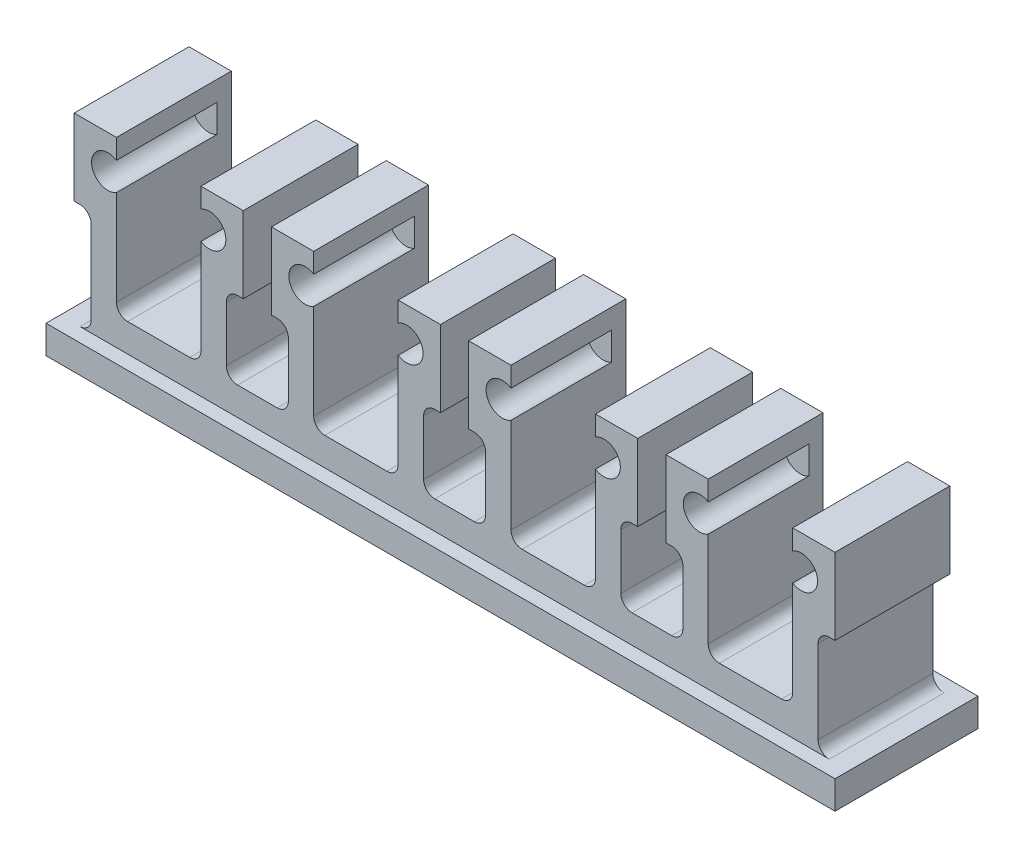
from build123d import *

# Parameters (mm, degrees)
SKETCH1_W          = 12
SKETCH1_H          = 6.3
EXTRUDE1_DEPTH     = 12.92
SKETCH3_W          = 6
SKETCH3_H          = 6.3
CUT_EXTRUDE1_DEPTH = 10.92
SKETCH4_R          = 1.16
CUT_EXTRUDE2_DEPTH = 6.3
SKETCH5_W          = 1.2
SKETCH5_H          = 6.3
CUT_EXTRUDE3_DEPTH = 7.5
FILLET9_R          = 0.79375
FILLET10_R         = 0.79375
FILLET11_R         = 0.79375
FILLET12_R         = 0.79375
SKETCH9_W          = 6.3
SKETCH9_H          = 2
EXTRUDE2_DEPTH     = 4.8
LPATTERN1_COUNT    = 4
LPATTERN1_PITCH    = 14
SKETCH10_W         = 6.3
SKETCH10_H         = 2
CUT_EXTRUDE4_DEPTH = 4.8
FILLET13_R         = 0.79375
FILLET14_R         = 0.79375
FILLET15_R         = 0.79375
FILLET16_R         = 0.79375
FILLET17_R         = 0.79375
FILLET18_R         = 0.79375
SKETCH11_W         = 56
SKETCH11_H         = 8.3
EXTRUDE3_DEPTH     = 2
FILLET21_R         = 0.79375
FILLET22_R         = 0.79375
EXTRUDE4_START     = 0.85
EXTRUDE4_DEPTH     = 0.85
EXTRUDE5_START     = 1
EXTRUDE5_DEPTH     = 1
EXTRUDE6_DEPTH     = 1.85


with BuildPart() as part:
    # Sketch1 → Extrude1 (new body)
    with BuildSketch(Plane(origin=(0, 0, 0), x_dir=(1, 0, 0), z_dir=(0, 1, 0))):
        with Locations((6, 3.15)):
            Rectangle(SKETCH1_W, SKETCH1_H)
    extrude(amount=EXTRUDE1_DEPTH)

    # Sketch3 → Cut-Extrude1 (cut)
    with BuildSketch(Plane(origin=(0, 12.92, 0), x_dir=(-1, 0, 0), z_dir=(0, 1, 0))):
        with Locations((-6, -3.15)):
            Rectangle(SKETCH3_W, SKETCH3_H)
    extrude(amount=-CUT_EXTRUDE1_DEPTH, mode=Mode.SUBTRACT)

    # Sketch4 → Cut-Extrude2 (cut)
    with BuildSketch(Plane.XY):
        with Locations((2.395, 10.52)):
            Circle(SKETCH4_R)
        with Locations((9.605, 10.52)):
            Circle(SKETCH4_R)
    extrude(amount=-CUT_EXTRUDE2_DEPTH, mode=Mode.SUBTRACT)

    # Sketch5 → Cut-Extrude3 (cut)
    with BuildSketch(Plane.XZ):
        with Locations((0.6, -3.15)):
            Rectangle(SKETCH5_W, SKETCH5_H)
        with Locations((11.4, -3.15)):
            Rectangle(SKETCH5_W, SKETCH5_H)
    extrude(amount=-CUT_EXTRUDE3_DEPTH, mode=Mode.SUBTRACT)

    # Fillet9
    fillet9_edges = [part.edges().sort_by_distance(p)[0] for p in [
        (10.8, 7.5, -3.15),
    ]]
    fillet(fillet9_edges, radius=FILLET9_R)

    # Fillet10
    fillet10_edges = [part.edges().sort_by_distance(p)[0] for p in [
        (1.2, 7.5, -3.15),
    ]]
    fillet(fillet10_edges, radius=FILLET10_R)

    # Fillet11
    fillet11_edges = [part.edges().sort_by_distance(p)[0] for p in [
        (9, 2, -3.15),
    ]]
    fillet(fillet11_edges, radius=FILLET11_R)

    # Fillet12
    fillet12_edges = [part.edges().sort_by_distance(p)[0] for p in [
        (3, 2, -3.15),
    ]]
    fillet(fillet12_edges, radius=FILLET12_R)

    # Sketch9 → Extrude2 (add)
    with BuildSketch(Plane.ZY.offset(-1.2)):
        with Locations((-3.15, 1)):
            Rectangle(SKETCH9_W, SKETCH9_H)
    extrude(amount=EXTRUDE2_DEPTH)


with BuildPart() as lpattern1_1:
    # LPattern1: pattern copy
    add(part.part.moved(Location(Vector(-1, 0, 0) * (1 * LPATTERN1_PITCH))))


with BuildPart() as lpattern1_2:
    # LPattern1: pattern copy
    add(part.part.moved(Location(Vector(-1, 0, 0) * (2 * LPATTERN1_PITCH))))


with BuildPart() as lpattern1_3:
    # LPattern1: pattern copy
    add(part.part.moved(Location(Vector(-1, 0, 0) * (3 * LPATTERN1_PITCH))))

    # Sketch10 → Cut-Extrude4 (cut)
    with BuildSketch(Plane.ZY.offset(45.6)):
        with Locations((-3.15, 1)):
            Rectangle(SKETCH10_W, SKETCH10_H)
    extrude(amount=-CUT_EXTRUDE4_DEPTH, mode=Mode.SUBTRACT)


with BuildPart() as part_1:
    add(part.part)

    # Combine1: union LPattern1_1, LPattern1_2, LPattern1_3
    add(lpattern1_1.part)
    add(lpattern1_2.part)
    add(lpattern1_3.part)

    # Fillet13
    fillet13_edges = [part_1.edges().sort_by_distance(p)[0] for p in [
        (-3.2, 2, -3.15),
    ]]
    fillet(fillet13_edges, radius=FILLET13_R)

    # Fillet14
    fillet14_edges = [part_1.edges().sort_by_distance(p)[0] for p in [
        (-17.2, 2, -3.15),
    ]]
    fillet(fillet14_edges, radius=FILLET14_R)

    # Fillet15
    fillet15_edges = [part_1.edges().sort_by_distance(p)[0] for p in [
        (-31.2, 2, -3.15),
    ]]
    fillet(fillet15_edges, radius=FILLET15_R)

    # Fillet16
    fillet16_edges = [part_1.edges().sort_by_distance(p)[0] for p in [
        (1.2, 2, -3.15),
    ]]
    fillet(fillet16_edges, radius=FILLET16_R)

    # Fillet17
    fillet17_edges = [part_1.edges().sort_by_distance(p)[0] for p in [
        (-12.8, 2, -3.15),
    ]]
    fillet(fillet17_edges, radius=FILLET17_R)

    # Fillet18
    fillet18_edges = [part_1.edges().sort_by_distance(p)[0] for p in [
        (-26.8, 2, -3.15),
    ]]
    fillet(fillet18_edges, radius=FILLET18_R)

    # Sketch11 → Extrude3 (add)
    with BuildSketch(Plane.XZ):
        with Locations((-15, -3.15)):
            Rectangle(SKETCH11_W, SKETCH11_H)
    extrude(amount=EXTRUDE3_DEPTH)

    # Fillet21
    fillet21_edges = [part_1.edges().sort_by_distance(p)[0] for p in [
        (-40.8, 0, -3.15),
    ]]
    fillet(fillet21_edges, radius=FILLET21_R)

    # Fillet22
    fillet22_edges = [part_1.edges().sort_by_distance(p)[0] for p in [
        (10.8, 0, -3.15),
    ]]
    fillet(fillet22_edges, radius=FILLET22_R)

    # Sketch13 → Extrude4 (add)
    with BuildSketch(Plane(origin=(0, 0, -6.3), x_dir=(-1, 0, 0), z_dir=(0, 0, -1)).offset(EXTRUDE4_START)):
        with BuildLine():
            Line((30.40625, 2), (27.59375, 2))
            ThreePointArc((27.59375, 2), (27.032483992, 2.232483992), (26.8, 2.79375))
            Line((26.8, 2.79375), (26.8, 6.70625))
            ThreePointArc((26.8, 6.70625), (27.032483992, 7.267516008), (27.59375, 7.5))
            Line((27.59375, 7.5), (28, 7.5))
            Line((28, 7.5), (28, 12.92))
            Line((28, 12.92), (25, 12.92))
            Line((25, 12.92), (25, 11.509734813))
            ThreePointArc((25, 11.509734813), (26.765, 10.52), (25, 9.530265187))
            Line((25, 9.530265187), (25, 2.79375))
            ThreePointArc((25, 2.79375), (24.767516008, 2.232483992), (24.20625, 2))
            Line((24.20625, 2), (19.79375, 2))
            ThreePointArc((19.79375, 2), (19.232483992, 2.232483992), (19, 2.79375))
            Line((19, 2.79375), (19, 9.530265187))
            ThreePointArc((19, 9.530265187), (17.235, 10.52), (19, 11.509734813))
            Line((19, 11.509734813), (19, 12.92))
            Line((19, 12.92), (16, 12.92))
            Line((16, 12.92), (16, 7.5))
            Line((16, 7.5), (16.40625, 7.5))
            ThreePointArc((16.40625, 7.5), (16.967516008, 7.267516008), (17.2, 6.70625))
            Line((17.2, 6.70625), (17.2, 2.79375))
            ThreePointArc((17.2, 2.79375), (16.967516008, 2.232483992), (16.40625, 2))
            Line((16.40625, 2), (13.59375, 2))
            ThreePointArc((13.59375, 2), (13.032483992, 2.232483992), (12.8, 2.79375))
            Line((12.8, 2.79375), (12.8, 6.70625))
            ThreePointArc((12.8, 6.70625), (13.032483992, 7.267516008), (13.59375, 7.5))
            Line((13.59375, 7.5), (14, 7.5))
            Line((14, 7.5), (14, 12.92))
            Line((14, 12.92), (11, 12.92))
            Line((11, 12.92), (11, 11.509734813))
            ThreePointArc((11, 11.509734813), (12.765, 10.52), (11, 9.530265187))
            Line((11, 9.530265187), (11, 2.79375))
            ThreePointArc((11, 2.79375), (10.767516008, 2.232483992), (10.20625, 2))
            Line((10.20625, 2), (5.79375, 2))
            ThreePointArc((5.79375, 2), (5.232483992, 2.232483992), (5, 2.79375))
            Line((5, 2.79375), (5, 9.530265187))
            ThreePointArc((5, 9.530265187), (3.235, 10.52), (5, 11.509734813))
            Line((5, 11.509734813), (5, 12.92))
            Line((5, 12.92), (2, 12.92))
            Line((2, 12.92), (2, 7.5))
            Line((2, 7.5), (2.40625, 7.5))
            ThreePointArc((2.40625, 7.5), (2.967516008, 7.267516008), (3.2, 6.70625))
            Line((3.2, 6.70625), (3.2, 2.79375))
            ThreePointArc((3.2, 2.79375), (2.967516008, 2.232483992), (2.40625, 2))
            Line((2.40625, 2), (-0.40625, 2))
            ThreePointArc((-0.40625, 2), (-0.967516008, 2.232483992), (-1.2, 2.79375))
            Line((-1.2, 2.79375), (-1.2, 6.70625))
            ThreePointArc((-1.2, 6.70625), (-0.967516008, 7.267516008), (-0.40625, 7.5))
            Line((-0.40625, 7.5), (0, 7.5))
            Line((0, 7.5), (0, 12.92))
            Line((0, 12.92), (-3, 12.92))
            Line((-3, 12.92), (-3, 11.509734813))
            ThreePointArc((-3, 11.509734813), (-1.235, 10.52), (-3, 9.530265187))
            Line((-3, 9.530265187), (-3, 2.79375))
            ThreePointArc((-3, 2.79375), (-3.232483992, 2.232483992), (-3.79375, 2))
            Line((-3.79375, 2), (-8.20625, 2))
            ThreePointArc((-8.20625, 2), (-8.767516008, 2.232483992), (-9, 2.79375))
            Line((-9, 2.79375), (-9, 9.530265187))
            ThreePointArc((-9, 9.530265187), (-10.765, 10.52), (-9, 11.509734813))
            Line((-9, 11.509734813), (-9, 12.92))
            Line((-9, 12.92), (-12, 12.92))
            Line((-12, 12.92), (-12, 7.5))
            Line((-12, 7.5), (-11.59375, 7.5))
            ThreePointArc((-11.59375, 7.5), (-11.032483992, 7.267516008), (-10.8, 6.70625))
            Line((-10.8, 6.70625), (-10.8, 0.79375))
            ThreePointArc((-10.8, 0.79375), (-11.032483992, 0.232483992), (-11.59375, 0))
            Line((-11.59375, 0), (41.59375, 0))
            ThreePointArc((41.59375, 0), (41.032483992, 0.232483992), (40.8, 0.79375))
            Line((40.8, 0.79375), (40.8, 6.70625))
            ThreePointArc((40.8, 6.70625), (41.032483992, 7.267516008), (41.59375, 7.5))
            Line((41.59375, 7.5), (42, 7.5))
            Line((42, 7.5), (42, 12.92))
            Line((42, 12.92), (39, 12.92))
            Line((39, 12.92), (39, 11.509734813))
            ThreePointArc((39, 11.509734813), (40.765, 10.52), (39, 9.530265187))
            Line((39, 9.530265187), (39, 2.79375))
            ThreePointArc((39, 2.79375), (38.767516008, 2.232483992), (38.20625, 2))
            Line((38.20625, 2), (33.79375, 2))
            ThreePointArc((33.79375, 2), (33.232483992, 2.232483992), (33, 2.79375))
            Line((33, 2.79375), (33, 9.530265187))
            ThreePointArc((33, 9.530265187), (31.235, 10.52), (33, 11.509734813))
            Line((33, 11.509734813), (33, 12.92))
            Line((33, 12.92), (30, 12.92))
            Line((30, 12.92), (30, 7.5))
            Line((30, 7.5), (30.40625, 7.5))
            ThreePointArc((30.40625, 7.5), (30.967516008, 7.267516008), (31.2, 6.70625))
            Line((31.2, 6.70625), (31.2, 2.79375))
            ThreePointArc((31.2, 2.79375), (30.967516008, 2.232483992), (30.40625, 2))
        make_face()
    extrude(amount=-EXTRUDE4_DEPTH)

    # Sketch15 → Extrude5 (add)
    with BuildSketch(Plane(origin=(0, 0, -7.15), x_dir=(-1, 0, 0), z_dir=(0, 0, -1)).offset(EXTRUDE5_START)):
        with BuildLine():
            Line((39, 9.110265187), (39, 11.089734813))
            Line((39, 11.089734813), (39, 12.92))
            Line((39, 12.92), (42, 12.92))
            Line((42, 12.92), (42, 7.5))
            Line((42, 7.5), (41.59375, 7.5))
            ThreePointArc((41.59375, 7.5), (41.032483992, 7.267516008), (40.8, 6.70625))
            Line((40.8, 6.70625), (40.8, 0.79375))
            ThreePointArc((40.8, 0.79375), (41.032483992, 0.232483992), (41.59375, 0))
            Line((41.59375, 0), (-11.59375, 0))
            ThreePointArc((-11.59375, 0), (-11.032483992, 0.232483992), (-10.8, 0.79375))
            Line((-10.8, 0.79375), (-10.8, 6.70625))
            ThreePointArc((-10.8, 6.70625), (-11.032483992, 7.267516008), (-11.59375, 7.5))
            Line((-11.59375, 7.5), (-12, 7.5))
            Line((-12, 7.5), (-12, 12.92))
            Line((-12, 12.92), (-9, 12.92))
            Line((-9, 12.92), (-9, 10.945428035))
            Line((-9, 10.945428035), (-9, 8.965958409))
            Line((-9, 8.965958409), (-9, 2.649443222))
            ThreePointArc((-9, 2.649443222), (-8.767516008, 2.088177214), (-8.20625, 1.855693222))
            Line((-8.20625, 1.855693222), (-3.79375, 1.855693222))
            ThreePointArc((-3.79375, 1.855693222), (-3.232483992, 2.088177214), (-3, 2.649443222))
            Line((-3, 2.649443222), (-3, 8.965958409))
            Line((-3, 8.965958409), (-3, 10.945428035))
            Line((-3, 10.945428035), (-3, 12.92))
            Line((-3, 12.92), (0, 12.92))
            Line((0, 12.92), (0, 7.5))
            Line((0, 7.5), (-0.40625, 7.5))
            ThreePointArc((-0.40625, 7.5), (-0.967516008, 7.267516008), (-1.2, 6.70625))
            Line((-1.2, 6.70625), (-1.2, 2.79375))
            ThreePointArc((-1.2, 2.79375), (-0.967516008, 2.232483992), (-0.40625, 2))
            Line((-0.40625, 2), (2.40625, 2))
            ThreePointArc((2.40625, 2), (2.967516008, 2.232483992), (3.2, 2.79375))
            Line((3.2, 2.79375), (3.2, 6.70625))
            ThreePointArc((3.2, 6.70625), (2.967516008, 7.267516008), (2.40625, 7.5))
            Line((2.40625, 7.5), (2, 7.5))
            Line((2, 7.5), (2, 12.92))
            Line((2, 12.92), (5, 12.92))
            Line((5, 12.92), (5, 11.089734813))
            Line((5, 11.089734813), (5, 9.110265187))
            Line((5, 9.110265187), (5, 2.79375))
            ThreePointArc((5, 2.79375), (5.232483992, 2.232483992), (5.79375, 2))
            Line((5.79375, 2), (10.20625, 2))
            ThreePointArc((10.20625, 2), (10.767516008, 2.232483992), (11, 2.79375))
            Line((11, 2.79375), (11, 9.110265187))
            Line((11, 9.110265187), (11, 11.089734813))
            Line((11, 11.089734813), (11, 12.92))
            Line((11, 12.92), (14, 12.92))
            Line((14, 12.92), (14, 7.5))
            Line((14, 7.5), (13.59375, 7.5))
            ThreePointArc((13.59375, 7.5), (13.032483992, 7.267516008), (12.8, 6.70625))
            Line((12.8, 6.70625), (12.8, 2.79375))
            ThreePointArc((12.8, 2.79375), (13.032483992, 2.232483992), (13.59375, 2))
            Line((13.59375, 2), (16.40625, 2))
            ThreePointArc((16.40625, 2), (16.967516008, 2.232483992), (17.2, 2.79375))
            Line((17.2, 2.79375), (17.2, 6.70625))
            ThreePointArc((17.2, 6.70625), (16.967516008, 7.267516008), (16.40625, 7.5))
            Line((16.40625, 7.5), (16, 7.5))
            Line((16, 7.5), (16, 12.92))
            Line((16, 12.92), (19, 12.92))
            Line((19, 12.92), (19, 11.089734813))
            Line((19, 11.089734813), (19, 9.110265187))
            Line((19, 9.110265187), (19, 2.79375))
            ThreePointArc((19, 2.79375), (19.232483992, 2.232483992), (19.79375, 2))
            Line((19.79375, 2), (24.20625, 2))
            ThreePointArc((24.20625, 2), (24.767516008, 2.232483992), (25, 2.79375))
            Line((25, 2.79375), (25, 9.110265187))
            Line((25, 9.110265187), (25, 11.089734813))
            Line((25, 11.089734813), (25, 12.92))
            Line((25, 12.92), (28, 12.92))
            Line((28, 12.92), (28, 7.5))
            Line((28, 7.5), (27.59375, 7.5))
            ThreePointArc((27.59375, 7.5), (27.032483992, 7.267516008), (26.8, 6.70625))
            Line((26.8, 6.70625), (26.8, 2.79375))
            ThreePointArc((26.8, 2.79375), (27.032483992, 2.232483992), (27.59375, 2))
            Line((27.59375, 2), (30.40625, 2))
            ThreePointArc((30.40625, 2), (30.967516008, 2.232483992), (31.2, 2.79375))
            Line((31.2, 2.79375), (31.2, 6.70625))
            ThreePointArc((31.2, 6.70625), (30.967516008, 7.267516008), (30.40625, 7.5))
            Line((30.40625, 7.5), (30, 7.5))
            Line((30, 7.5), (30, 12.92))
            Line((30, 12.92), (33, 12.92))
            Line((33, 12.92), (33, 11.089734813))
            Line((33, 11.089734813), (33, 9.110265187))
            Line((33, 9.110265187), (33, 2.79375))
            ThreePointArc((33, 2.79375), (33.232483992, 2.232483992), (33.79375, 2))
            Line((33.79375, 2), (38.20625, 2))
            ThreePointArc((38.20625, 2), (38.767516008, 2.232483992), (39, 2.79375))
            Line((39, 2.79375), (39, 9.110265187))
        make_face()
    extrude(amount=-EXTRUDE5_DEPTH)

    # Sketch17 → Extrude6 (add)
    with BuildSketch(Plane(origin=(0, 0, -7.3), x_dir=(-1, 0, 0), z_dir=(0, 0, -1))):
        Polygon((43, 0), (41.59375, 0), (-11.59375, 0), (-13, 0), (-13, -2), (43, -2), align=None)
    extrude(amount=EXTRUDE6_DEPTH)


solid = part_1.part
